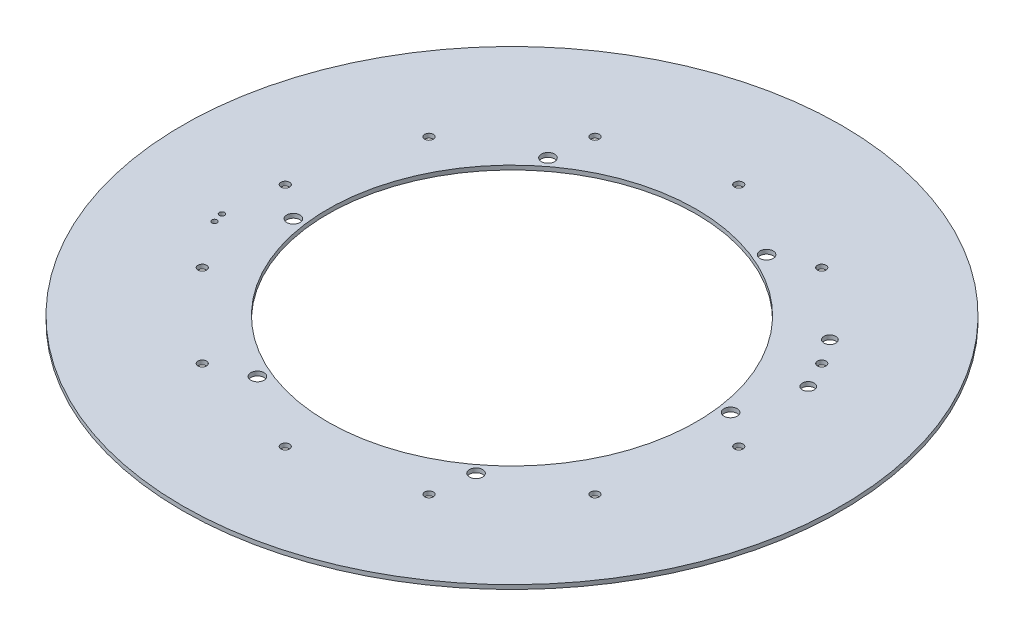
from build123d import *

# Parameters (mm, degrees)
SKETCH1_R             = 125
SKETCH1_R_2           = 69.9
BOSS_EXTRUDE1_DEPTH   = 1.6
F_4_CLEARANCE_HOLE1_D = 3.2639
F_5_0MM_DOWEL_HOLE1_D = 5
F_8_CLEARANCE_HOLE1_D = 4.4958
F_2_0MM_DOWEL_HOLE1_D = 2


with BuildPart() as part:
    # Sketch1 → Boss-Extrude1 (new body)
    with BuildSketch(Plane(origin=(0, 0, 0), x_dir=(1, 0, 0), z_dir=(0, 1, 0))):
        with Locations(Location((0, 0, 0), (0, 0, 270))):
            Circle(SKETCH1_R)
        with Locations(Location((0, 0, 0), (0, 0, 270))):
            Circle(SKETCH1_R_2, mode=Mode.SUBTRACT)
    extrude(amount=BOSS_EXTRUDE1_DEPTH)

    # 4 Clearance Hole1 (through all)
    with Locations(Plane(origin=(0, 1.6, 0), x_dir=(1, 0, 0), z_dir=(0, 1, 0))):
        with Locations((86, 0), (74.478184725, -43), (43, -74.478184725), (0, -86), (-43, -74.478184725), (-74.478184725, -43), (-86, 0), (-74.478184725, 43), (-43, 74.478184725), (0, 86), (43, 74.478184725), (74.478184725, 43)):
            Hole(F_4_CLEARANCE_HOLE1_D / 2)

    # 5.0mm Dowel Hole1 (through all)
    with Locations(Plane(origin=(0, 1.6, 0), x_dir=(1, 0, 0), z_dir=(0, 1, 0))):
        with Locations((73.267775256, 9.645885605), (44.987469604, -58.628811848), (-28.280305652, -68.274697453), (-73.267775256, -9.645885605), (-44.987469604, 58.628811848), (28.280305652, 68.274697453)):
            Hole(F_5_0MM_DOWEL_HOLE1_D / 2)

    # 8 Clearance Hole1 (through all)
    with Locations(Plane(origin=(0, 1.6, 0), x_dir=(1, 0, 0), z_dir=(0, 1, 0))):
        with Locations((79.453639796, 32.910775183), (68.228387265, 52.353482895)):
            Hole(F_8_CLEARANCE_HOLE1_D / 2)

    # 2.0mm Dowel Hole1 (through all)
    with Locations(Plane(origin=(0, 1.6, 0), x_dir=(1, 0, 0), z_dir=(0, 1, 0))):
        with Locations((-88.395656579, -21.614992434), (-87.360380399, -25.478695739)):
            Hole(F_2_0MM_DOWEL_HOLE1_D / 2)


solid = part.part
